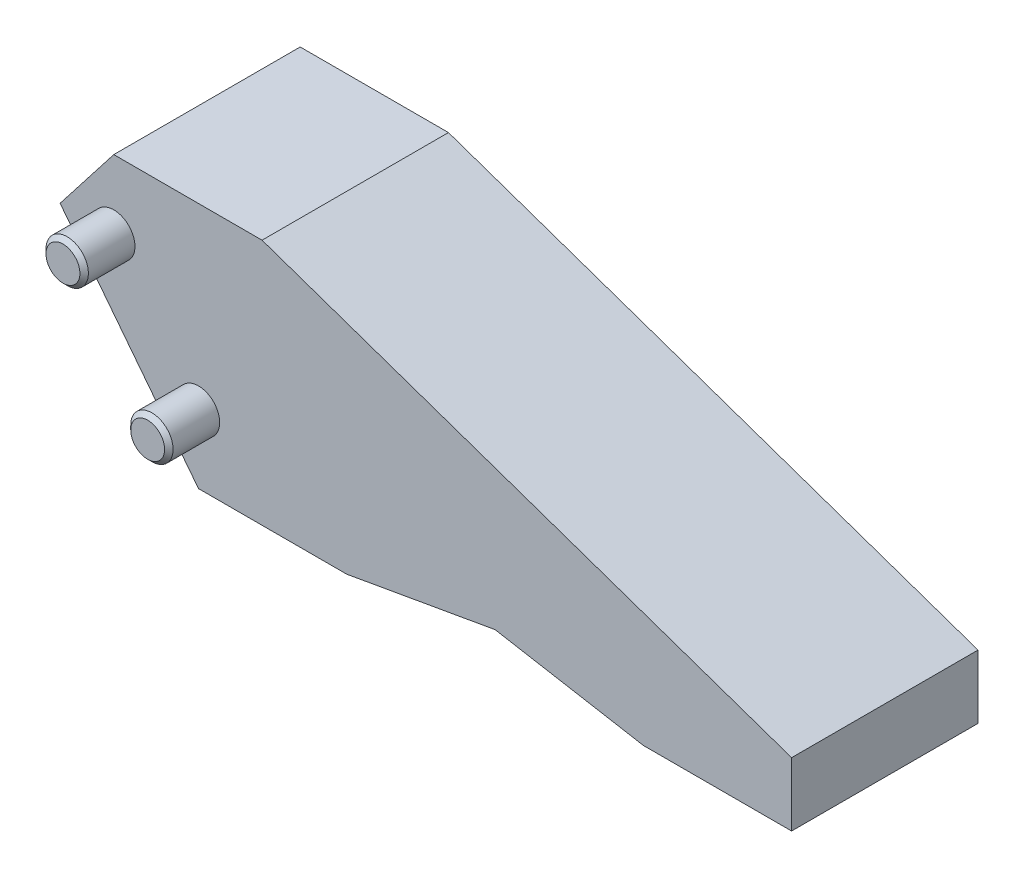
ISO-10303-21;
HEADER;
FILE_DESCRIPTION(('STEP AP214'),'2;1');
FILE_NAME('part.step','',(''),(''),'','','');
FILE_SCHEMA(('AUTOMOTIVE_DESIGN { 1 0 10303 214 1 1 1 1 }'));
ENDSEC;
DATA;
#1=APPLICATION_CONTEXT('core data for automotive mechanical design processes');
#2=APPLICATION_PROTOCOL_DEFINITION('international standard','automotive_design',2000,#1);
#3=PRODUCT_CONTEXT('',#1,'mechanical');
#4=PRODUCT('Part','Part','',(#3));
#5=PRODUCT_RELATED_PRODUCT_CATEGORY('part','',(#4));
#6=PRODUCT_DEFINITION_FORMATION('','',#4);
#7=PRODUCT_DEFINITION_CONTEXT('part definition',#1,'design');
#8=PRODUCT_DEFINITION('design','',#6,#7);
#9=PRODUCT_DEFINITION_SHAPE('','',#8);
#10=(LENGTH_UNIT() NAMED_UNIT(*) SI_UNIT(.MILLI.,.METRE.));
#11=(NAMED_UNIT(*) PLANE_ANGLE_UNIT() SI_UNIT($,.RADIAN.));
#12=(NAMED_UNIT(*) SI_UNIT($,.STERADIAN.) SOLID_ANGLE_UNIT());
#13=UNCERTAINTY_MEASURE_WITH_UNIT(LENGTH_MEASURE(1.E-05),#10,'distance_accuracy_value','');
#14=(GEOMETRIC_REPRESENTATION_CONTEXT(3) GLOBAL_UNCERTAINTY_ASSIGNED_CONTEXT((#13)) GLOBAL_UNIT_ASSIGNED_CONTEXT((#10,
#11,#12)) REPRESENTATION_CONTEXT('',''));
#15=CARTESIAN_POINT('',(0.,0.,0.));
#16=DIRECTION('',(0.,0.,1.));
#17=DIRECTION('',(1.,0.,0.));
#18=AXIS2_PLACEMENT_3D('',#15,#16,#17);
#19=CARTESIAN_POINT('',(-12.6689495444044,0.,22.));
#20=DIRECTION('',(0.,0.,1.));
#21=DIRECTION('',(1.,0.,0.));
#22=AXIS2_PLACEMENT_3D('',#19,#20,#21);
#23=PLANE('',#22);
#24=CARTESIAN_POINT('',(0.,0.,22.));
#25=DIRECTION('',(0.,0.,1.));
#26=DIRECTION('',(1.,0.,0.));
#27=AXIS2_PLACEMENT_3D('',#24,#25,#26);
#28=CIRCLE('',#27,5.);
#29=CARTESIAN_POINT('',(5.,0.,22.));
#30=VERTEX_POINT('',#29);
#31=EDGE_CURVE('E127',#30,#30,#28,.T.);
#32=ORIENTED_EDGE('',*,*,#31,.F.);
#33=EDGE_LOOP('',(#32));
#34=FACE_BOUND('',#33,.T.);
#35=DIRECTION('',(-0.613967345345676,-0.789331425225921,0.));
#36=VECTOR('',#35,1.);
#37=CARTESIAN_POINT('',(-12.6689495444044,0.,22.));
#38=LINE('',#37,#36);
#39=CARTESIAN_POINT('',(0.,16.2875111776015,22.));
#40=VERTEX_POINT('',#39);
#41=CARTESIAN_POINT('',(-12.6689495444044,0.,22.));
#42=VERTEX_POINT('',#41);
#43=EDGE_CURVE('E147',#40,#42,#38,.T.);
#44=ORIENTED_EDGE('',*,*,#43,.T.);
#45=DIRECTION('',(0.613967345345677,-0.78933142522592,0.));
#46=VECTOR('',#45,1.);
#47=CARTESIAN_POINT('',(20.,-42.,22.));
#48=LINE('',#47,#46);
#49=CARTESIAN_POINT('',(20.,-42.,22.));
#50=VERTEX_POINT('',#49);
#51=EDGE_CURVE('E119',#42,#50,#48,.T.);
#52=ORIENTED_EDGE('',*,*,#51,.T.);
#53=DIRECTION('',(1.,0.,0.));
#54=VECTOR('',#53,1.);
#55=CARTESIAN_POINT('',(55.,-42.,22.));
#56=LINE('',#55,#54);
#57=CARTESIAN_POINT('',(55.,-42.,22.));
#58=VERTEX_POINT('',#57);
#59=EDGE_CURVE('E150',#50,#58,#56,.T.);
#60=ORIENTED_EDGE('',*,*,#59,.T.);
#61=DIRECTION('',(0.984807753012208,0.173648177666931,0.));
#62=VECTOR('',#61,1.);
#63=CARTESIAN_POINT('',(90.,-35.8285556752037,22.));
#64=LINE('',#63,#62);
#65=CARTESIAN_POINT('',(90.,-35.8285556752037,22.));
#66=VERTEX_POINT('',#65);
#67=EDGE_CURVE('E152',#58,#66,#64,.T.);
#68=ORIENTED_EDGE('',*,*,#67,.T.);
#69=DIRECTION('',(0.984807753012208,-0.173648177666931,0.));
#70=VECTOR('',#69,1.);
#71=CARTESIAN_POINT('',(125.,-42.,22.));
#72=LINE('',#71,#70);
#73=CARTESIAN_POINT('',(125.,-42.,22.));
#74=VERTEX_POINT('',#73);
#75=EDGE_CURVE('E154',#66,#74,#72,.T.);
#76=ORIENTED_EDGE('',*,*,#75,.T.);
#77=DIRECTION('',(1.,0.,0.));
#78=VECTOR('',#77,1.);
#79=CARTESIAN_POINT('',(160.,-42.,22.));
#80=LINE('',#79,#78);
#81=CARTESIAN_POINT('',(160.,-42.,22.));
#82=VERTEX_POINT('',#81);
#83=EDGE_CURVE('E156',#74,#82,#80,.T.);
#84=ORIENTED_EDGE('',*,*,#83,.T.);
#85=DIRECTION('',(0.,1.,0.));
#86=VECTOR('',#85,1.);
#87=CARTESIAN_POINT('',(160.,-27.,22.));
#88=LINE('',#87,#86);
#89=CARTESIAN_POINT('',(160.,-27.,22.));
#90=VERTEX_POINT('',#89);
#91=EDGE_CURVE('E158',#82,#90,#88,.T.);
#92=ORIENTED_EDGE('',*,*,#91,.T.);
#93=DIRECTION('',(-0.944943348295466,0.327233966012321,0.));
#94=VECTOR('',#93,1.);
#95=CARTESIAN_POINT('',(35.,16.2875111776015,22.));
#96=LINE('',#95,#94);
#97=CARTESIAN_POINT('',(35.,16.2875111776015,22.));
#98=VERTEX_POINT('',#97);
#99=EDGE_CURVE('E52',#90,#98,#96,.T.);
#100=ORIENTED_EDGE('',*,*,#99,.T.);
#101=DIRECTION('',(-1.,0.,0.));
#102=VECTOR('',#101,1.);
#103=CARTESIAN_POINT('',(0.,16.2875111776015,22.));
#104=LINE('',#103,#102);
#105=EDGE_CURVE('E47',#98,#40,#104,.T.);
#106=ORIENTED_EDGE('',*,*,#105,.T.);
#107=EDGE_LOOP('',(#44,#52,#60,#68,#76,#84,#92,#100,#106));
#108=FACE_BOUND('',#107,.T.);
#109=CARTESIAN_POINT('',(20.,-26.,22.));
#110=DIRECTION('',(0.,0.,1.));
#111=DIRECTION('',(1.,0.,0.));
#112=AXIS2_PLACEMENT_3D('',#109,#110,#111);
#113=CIRCLE('',#112,5.);
#114=CARTESIAN_POINT('',(25.,-26.,22.));
#115=VERTEX_POINT('',#114);
#116=EDGE_CURVE('E130',#115,#115,#113,.T.);
#117=ORIENTED_EDGE('',*,*,#116,.F.);
#118=EDGE_LOOP('',(#117));
#119=FACE_BOUND('',#118,.T.);
#120=ADVANCED_FACE('F32',(#34,#108,#119),#23,.T.);
#121=CARTESIAN_POINT('',(-12.6689495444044,0.,-22.));
#122=DIRECTION('',(0.,0.,1.));
#123=DIRECTION('',(1.,0.,0.));
#124=AXIS2_PLACEMENT_3D('',#121,#122,#123);
#125=PLANE('',#124);
#126=CARTESIAN_POINT('',(0.,0.,-22.));
#127=DIRECTION('',(0.,0.,1.));
#128=DIRECTION('',(1.,0.,0.));
#129=AXIS2_PLACEMENT_3D('',#126,#127,#128);
#130=CIRCLE('',#129,5.);
#131=CARTESIAN_POINT('',(5.,0.,-22.));
#132=VERTEX_POINT('',#131);
#133=EDGE_CURVE('E433',#132,#132,#130,.F.);
#134=ORIENTED_EDGE('',*,*,#133,.F.);
#135=EDGE_LOOP('',(#134));
#136=FACE_BOUND('',#135,.T.);
#137=DIRECTION('',(-0.613967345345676,-0.789331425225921,0.));
#138=VECTOR('',#137,1.);
#139=CARTESIAN_POINT('',(-12.6689495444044,0.,-22.));
#140=LINE('',#139,#138);
#141=CARTESIAN_POINT('',(0.,16.2875111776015,-22.));
#142=VERTEX_POINT('',#141);
#143=CARTESIAN_POINT('',(-12.6689495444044,0.,-22.));
#144=VERTEX_POINT('',#143);
#145=EDGE_CURVE('E109',#142,#144,#140,.T.);
#146=ORIENTED_EDGE('',*,*,#145,.F.);
#147=DIRECTION('',(-1.,0.,0.));
#148=VECTOR('',#147,1.);
#149=CARTESIAN_POINT('',(0.,16.2875111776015,-22.));
#150=LINE('',#149,#148);
#151=CARTESIAN_POINT('',(35.,16.2875111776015,-22.));
#152=VERTEX_POINT('',#151);
#153=EDGE_CURVE('E145',#152,#142,#150,.T.);
#154=ORIENTED_EDGE('',*,*,#153,.F.);
#155=DIRECTION('',(-0.944943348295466,0.327233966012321,0.));
#156=VECTOR('',#155,1.);
#157=CARTESIAN_POINT('',(35.,16.2875111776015,-22.));
#158=LINE('',#157,#156);
#159=CARTESIAN_POINT('',(160.,-27.,-22.));
#160=VERTEX_POINT('',#159);
#161=EDGE_CURVE('E143',#160,#152,#158,.T.);
#162=ORIENTED_EDGE('',*,*,#161,.F.);
#163=DIRECTION('',(0.,1.,0.));
#164=VECTOR('',#163,1.);
#165=CARTESIAN_POINT('',(160.,-27.,-22.));
#166=LINE('',#165,#164);
#167=CARTESIAN_POINT('',(160.,-42.,-22.));
#168=VERTEX_POINT('',#167);
#169=EDGE_CURVE('E141',#168,#160,#166,.T.);
#170=ORIENTED_EDGE('',*,*,#169,.F.);
#171=DIRECTION('',(1.,0.,0.));
#172=VECTOR('',#171,1.);
#173=CARTESIAN_POINT('',(160.,-42.,-22.));
#174=LINE('',#173,#172);
#175=CARTESIAN_POINT('',(125.,-42.,-22.));
#176=VERTEX_POINT('',#175);
#177=EDGE_CURVE('E139',#176,#168,#174,.T.);
#178=ORIENTED_EDGE('',*,*,#177,.F.);
#179=DIRECTION('',(0.984807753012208,-0.173648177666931,0.));
#180=VECTOR('',#179,1.);
#181=CARTESIAN_POINT('',(125.,-42.,-22.));
#182=LINE('',#181,#180);
#183=CARTESIAN_POINT('',(90.,-35.8285556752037,-22.));
#184=VERTEX_POINT('',#183);
#185=EDGE_CURVE('E137',#184,#176,#182,.T.);
#186=ORIENTED_EDGE('',*,*,#185,.F.);
#187=DIRECTION('',(0.984807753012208,0.173648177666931,0.));
#188=VECTOR('',#187,1.);
#189=CARTESIAN_POINT('',(90.,-35.8285556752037,-22.));
#190=LINE('',#189,#188);
#191=CARTESIAN_POINT('',(55.,-42.,-22.));
#192=VERTEX_POINT('',#191);
#193=EDGE_CURVE('E135',#192,#184,#190,.T.);
#194=ORIENTED_EDGE('',*,*,#193,.F.);
#195=DIRECTION('',(1.,0.,0.));
#196=VECTOR('',#195,1.);
#197=CARTESIAN_POINT('',(55.,-42.,-22.));
#198=LINE('',#197,#196);
#199=CARTESIAN_POINT('',(20.,-42.,-22.));
#200=VERTEX_POINT('',#199);
#201=EDGE_CURVE('E111',#200,#192,#198,.T.);
#202=ORIENTED_EDGE('',*,*,#201,.F.);
#203=DIRECTION('',(0.613967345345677,-0.78933142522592,0.));
#204=VECTOR('',#203,1.);
#205=CARTESIAN_POINT('',(20.,-42.,-22.));
#206=LINE('',#205,#204);
#207=EDGE_CURVE('E103',#144,#200,#206,.T.);
#208=ORIENTED_EDGE('',*,*,#207,.F.);
#209=EDGE_LOOP('',(#146,#154,#162,#170,#178,#186,#194,#202,#208));
#210=FACE_BOUND('',#209,.T.);
#211=CARTESIAN_POINT('',(20.,-26.,-22.));
#212=DIRECTION('',(0.,0.,1.));
#213=DIRECTION('',(1.,0.,0.));
#214=AXIS2_PLACEMENT_3D('',#211,#212,#213);
#215=CIRCLE('',#214,5.);
#216=CARTESIAN_POINT('',(25.,-26.,-22.));
#217=VERTEX_POINT('',#216);
#218=EDGE_CURVE('E431',#217,#217,#215,.F.);
#219=ORIENTED_EDGE('',*,*,#218,.F.);
#220=EDGE_LOOP('',(#219));
#221=FACE_BOUND('',#220,.T.);
#222=ADVANCED_FACE('F105',(#136,#210,#221),#125,.F.);
#223=CARTESIAN_POINT('',(-12.6689495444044,0.,22.));
#224=DIRECTION('',(0.789331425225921,-0.613967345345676,0.));
#225=DIRECTION('',(0.613967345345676,0.789331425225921,0.));
#226=AXIS2_PLACEMENT_3D('',#223,#224,#225);
#227=PLANE('',#226);
#228=ORIENTED_EDGE('',*,*,#145,.T.);
#229=DIRECTION('',(0.,0.,-1.));
#230=VECTOR('',#229,1.);
#231=CARTESIAN_POINT('',(-12.6689495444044,0.,22.));
#232=LINE('',#231,#230);
#233=EDGE_CURVE('E117',#42,#144,#232,.T.);
#234=ORIENTED_EDGE('',*,*,#233,.F.);
#235=ORIENTED_EDGE('',*,*,#43,.F.);
#236=DIRECTION('',(0.,0.,-1.));
#237=VECTOR('',#236,1.);
#238=CARTESIAN_POINT('',(0.,16.2875111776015,22.));
#239=LINE('',#238,#237);
#240=EDGE_CURVE('E126',#40,#142,#239,.T.);
#241=ORIENTED_EDGE('',*,*,#240,.T.);
#242=EDGE_LOOP('',(#228,#234,#235,#241));
#243=FACE_BOUND('',#242,.T.);
#244=ADVANCED_FACE('F34',(#243),#227,.F.);
#245=CARTESIAN_POINT('',(20.,-42.,22.));
#246=DIRECTION('',(0.78933142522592,0.613967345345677,0.));
#247=DIRECTION('',(-0.613967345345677,0.78933142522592,0.));
#248=AXIS2_PLACEMENT_3D('',#245,#246,#247);
#249=PLANE('',#248);
#250=ORIENTED_EDGE('',*,*,#207,.T.);
#251=DIRECTION('',(0.,0.,-1.));
#252=VECTOR('',#251,1.);
#253=CARTESIAN_POINT('',(20.,-42.,22.));
#254=LINE('',#253,#252);
#255=EDGE_CURVE('E123',#50,#200,#254,.T.);
#256=ORIENTED_EDGE('',*,*,#255,.F.);
#257=ORIENTED_EDGE('',*,*,#51,.F.);
#258=ORIENTED_EDGE('',*,*,#233,.T.);
#259=EDGE_LOOP('',(#250,#256,#257,#258));
#260=FACE_BOUND('',#259,.T.);
#261=ADVANCED_FACE('F118',(#260),#249,.F.);
#262=CARTESIAN_POINT('',(55.,-42.,22.));
#263=DIRECTION('',(0.,1.,0.));
#264=DIRECTION('',(-1.,0.,0.));
#265=AXIS2_PLACEMENT_3D('',#262,#263,#264);
#266=PLANE('',#265);
#267=ORIENTED_EDGE('',*,*,#201,.T.);
#268=DIRECTION('',(0.,0.,-1.));
#269=VECTOR('',#268,1.);
#270=CARTESIAN_POINT('',(55.,-42.,22.));
#271=LINE('',#270,#269);
#272=EDGE_CURVE('E178',#58,#192,#271,.T.);
#273=ORIENTED_EDGE('',*,*,#272,.F.);
#274=ORIENTED_EDGE('',*,*,#59,.F.);
#275=ORIENTED_EDGE('',*,*,#255,.T.);
#276=EDGE_LOOP('',(#267,#273,#274,#275));
#277=FACE_BOUND('',#276,.T.);
#278=ADVANCED_FACE('F251',(#277),#266,.F.);
#279=CARTESIAN_POINT('',(90.,-35.8285556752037,22.));
#280=DIRECTION('',(-0.173648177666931,0.984807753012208,0.));
#281=DIRECTION('',(-0.984807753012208,-0.173648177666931,0.));
#282=AXIS2_PLACEMENT_3D('',#279,#280,#281);
#283=PLANE('',#282);
#284=ORIENTED_EDGE('',*,*,#193,.T.);
#285=DIRECTION('',(0.,0.,-1.));
#286=VECTOR('',#285,1.);
#287=CARTESIAN_POINT('',(90.,-35.8285556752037,22.));
#288=LINE('',#287,#286);
#289=EDGE_CURVE('E175',#66,#184,#288,.T.);
#290=ORIENTED_EDGE('',*,*,#289,.F.);
#291=ORIENTED_EDGE('',*,*,#67,.F.);
#292=ORIENTED_EDGE('',*,*,#272,.T.);
#293=EDGE_LOOP('',(#284,#290,#291,#292));
#294=FACE_BOUND('',#293,.T.);
#295=ADVANCED_FACE('F247',(#294),#283,.F.);
#296=CARTESIAN_POINT('',(125.,-42.,22.));
#297=DIRECTION('',(0.173648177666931,0.984807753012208,0.));
#298=DIRECTION('',(-0.984807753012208,0.173648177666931,0.));
#299=AXIS2_PLACEMENT_3D('',#296,#297,#298);
#300=PLANE('',#299);
#301=ORIENTED_EDGE('',*,*,#185,.T.);
#302=DIRECTION('',(0.,0.,-1.));
#303=VECTOR('',#302,1.);
#304=CARTESIAN_POINT('',(125.,-42.,22.));
#305=LINE('',#304,#303);
#306=EDGE_CURVE('E172',#74,#176,#305,.T.);
#307=ORIENTED_EDGE('',*,*,#306,.F.);
#308=ORIENTED_EDGE('',*,*,#75,.F.);
#309=ORIENTED_EDGE('',*,*,#289,.T.);
#310=EDGE_LOOP('',(#301,#307,#308,#309));
#311=FACE_BOUND('',#310,.T.);
#312=ADVANCED_FACE('F243',(#311),#300,.F.);
#313=CARTESIAN_POINT('',(160.,-42.,22.));
#314=DIRECTION('',(0.,1.,0.));
#315=DIRECTION('',(0.,0.,1.));
#316=AXIS2_PLACEMENT_3D('',#313,#314,#315);
#317=PLANE('',#316);
#318=ORIENTED_EDGE('',*,*,#177,.T.);
#319=DIRECTION('',(0.,0.,-1.));
#320=VECTOR('',#319,1.);
#321=CARTESIAN_POINT('',(160.,-42.,22.));
#322=LINE('',#321,#320);
#323=EDGE_CURVE('E169',#82,#168,#322,.T.);
#324=ORIENTED_EDGE('',*,*,#323,.F.);
#325=ORIENTED_EDGE('',*,*,#83,.F.);
#326=ORIENTED_EDGE('',*,*,#306,.T.);
#327=EDGE_LOOP('',(#318,#324,#325,#326));
#328=FACE_BOUND('',#327,.T.);
#329=ADVANCED_FACE('F239',(#328),#317,.F.);
#330=CARTESIAN_POINT('',(160.,-27.,22.));
#331=DIRECTION('',(-1.,0.,0.));
#332=DIRECTION('',(0.,0.,1.));
#333=AXIS2_PLACEMENT_3D('',#330,#331,#332);
#334=PLANE('',#333);
#335=ORIENTED_EDGE('',*,*,#169,.T.);
#336=DIRECTION('',(0.,0.,-1.));
#337=VECTOR('',#336,1.);
#338=CARTESIAN_POINT('',(160.,-27.,22.));
#339=LINE('',#338,#337);
#340=EDGE_CURVE('E166',#90,#160,#339,.T.);
#341=ORIENTED_EDGE('',*,*,#340,.F.);
#342=ORIENTED_EDGE('',*,*,#91,.F.);
#343=ORIENTED_EDGE('',*,*,#323,.T.);
#344=EDGE_LOOP('',(#335,#341,#342,#343));
#345=FACE_BOUND('',#344,.T.);
#346=ADVANCED_FACE('F235',(#345),#334,.F.);
#347=CARTESIAN_POINT('',(35.,16.2875111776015,22.));
#348=DIRECTION('',(-0.327233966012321,-0.944943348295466,0.));
#349=DIRECTION('',(0.944943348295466,-0.327233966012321,0.));
#350=AXIS2_PLACEMENT_3D('',#347,#348,#349);
#351=PLANE('',#350);
#352=ORIENTED_EDGE('',*,*,#161,.T.);
#353=DIRECTION('',(0.,0.,-1.));
#354=VECTOR('',#353,1.);
#355=CARTESIAN_POINT('',(35.,16.2875111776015,22.));
#356=LINE('',#355,#354);
#357=EDGE_CURVE('E163',#98,#152,#356,.T.);
#358=ORIENTED_EDGE('',*,*,#357,.F.);
#359=ORIENTED_EDGE('',*,*,#99,.F.);
#360=ORIENTED_EDGE('',*,*,#340,.T.);
#361=EDGE_LOOP('',(#352,#358,#359,#360));
#362=FACE_BOUND('',#361,.T.);
#363=ADVANCED_FACE('F231',(#362),#351,.F.);
#364=CARTESIAN_POINT('',(0.,16.2875111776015,22.));
#365=DIRECTION('',(0.,-1.,0.));
#366=DIRECTION('',(1.,0.,0.));
#367=AXIS2_PLACEMENT_3D('',#364,#365,#366);
#368=PLANE('',#367);
#369=ORIENTED_EDGE('',*,*,#153,.T.);
#370=ORIENTED_EDGE('',*,*,#240,.F.);
#371=ORIENTED_EDGE('',*,*,#105,.F.);
#372=ORIENTED_EDGE('',*,*,#357,.T.);
#373=EDGE_LOOP('',(#369,#370,#371,#372));
#374=FACE_BOUND('',#373,.T.);
#375=ADVANCED_FACE('F227',(#374),#368,.F.);
#376=CARTESIAN_POINT('',(20.,-26.,-34.));
#377=DIRECTION('',(0.,0.,1.));
#378=DIRECTION('',(1.,0.,0.));
#379=AXIS2_PLACEMENT_3D('',#376,#377,#378);
#380=PLANE('',#379);
#381=CARTESIAN_POINT('',(20.,-26.,-34.));
#382=DIRECTION('',(0.,0.,1.));
#383=DIRECTION('',(1.,0.,0.));
#384=AXIS2_PLACEMENT_3D('',#381,#382,#383);
#385=CIRCLE('',#384,3.99999999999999);
#386=CARTESIAN_POINT('',(24.,-26.,-34.));
#387=VERTEX_POINT('',#386);
#388=EDGE_CURVE('E11',#387,#387,#385,.F.);
#389=ORIENTED_EDGE('',*,*,#388,.T.);
#390=EDGE_LOOP('',(#389));
#391=FACE_BOUND('',#390,.T.);
#392=ADVANCED_FACE('F230',(#391),#380,.F.);
#393=CARTESIAN_POINT('',(20.,-26.,34.));
#394=DIRECTION('',(0.,0.,-1.));
#395=DIRECTION('',(-1.,0.,0.));
#396=AXIS2_PLACEMENT_3D('',#393,#394,#395);
#397=CYLINDRICAL_SURFACE('',#396,5.);
#398=CARTESIAN_POINT('',(20.,-26.,-33.));
#399=DIRECTION('',(0.,0.,1.));
#400=DIRECTION('',(1.,0.,0.));
#401=AXIS2_PLACEMENT_3D('',#398,#399,#400);
#402=CIRCLE('',#401,5.);
#403=CARTESIAN_POINT('',(25.,-26.,-33.));
#404=VERTEX_POINT('',#403);
#405=EDGE_CURVE('E40',#404,#404,#402,.T.);
#406=ORIENTED_EDGE('',*,*,#405,.T.);
#407=EDGE_LOOP('',(#406));
#408=FACE_BOUND('',#407,.T.);
#409=ORIENTED_EDGE('',*,*,#218,.T.);
#410=EDGE_LOOP('',(#409));
#411=FACE_BOUND('',#410,.T.);
#412=ADVANCED_FACE('F201',(#408,#411),#397,.T.);
#413=CARTESIAN_POINT('',(20.,-26.,33.));
#414=DIRECTION('',(0.,0.,1.));
#415=DIRECTION('',(1.,0.,0.));
#416=AXIS2_PLACEMENT_3D('',#413,#414,#415);
#417=CIRCLE('',#416,5.);
#418=CARTESIAN_POINT('',(25.,-26.,33.));
#419=VERTEX_POINT('',#418);
#420=EDGE_CURVE('E190',#419,#419,#417,.F.);
#421=ORIENTED_EDGE('',*,*,#420,.T.);
#422=EDGE_LOOP('',(#421));
#423=FACE_BOUND('',#422,.T.);
#424=ORIENTED_EDGE('',*,*,#116,.T.);
#425=EDGE_LOOP('',(#424));
#426=FACE_BOUND('',#425,.T.);
#427=ADVANCED_FACE('F328',(#423,#426),#397,.T.);
#428=CARTESIAN_POINT('',(20.,-26.,34.));
#429=DIRECTION('',(0.,0.,1.));
#430=DIRECTION('',(1.,0.,0.));
#431=AXIS2_PLACEMENT_3D('',#428,#429,#430);
#432=PLANE('',#431);
#433=CARTESIAN_POINT('',(20.,-26.,34.));
#434=DIRECTION('',(0.,0.,1.));
#435=DIRECTION('',(1.,0.,0.));
#436=AXIS2_PLACEMENT_3D('',#433,#434,#435);
#437=CIRCLE('',#436,3.99999999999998);
#438=CARTESIAN_POINT('',(24.,-26.,34.));
#439=VERTEX_POINT('',#438);
#440=EDGE_CURVE('E187',#439,#439,#437,.T.);
#441=ORIENTED_EDGE('',*,*,#440,.T.);
#442=EDGE_LOOP('',(#441));
#443=FACE_BOUND('',#442,.T.);
#444=ADVANCED_FACE('F335',(#443),#432,.T.);
#445=CARTESIAN_POINT('',(0.,0.,-34.));
#446=DIRECTION('',(0.,0.,1.));
#447=DIRECTION('',(1.,0.,0.));
#448=AXIS2_PLACEMENT_3D('',#445,#446,#447);
#449=PLANE('',#448);
#450=CARTESIAN_POINT('',(0.,0.,-34.));
#451=DIRECTION('',(0.,0.,1.));
#452=DIRECTION('',(1.,0.,0.));
#453=AXIS2_PLACEMENT_3D('',#450,#451,#452);
#454=CIRCLE('',#453,3.99999999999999);
#455=CARTESIAN_POINT('',(3.99999999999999,0.,-34.));
#456=VERTEX_POINT('',#455);
#457=EDGE_CURVE('E196',#456,#456,#454,.F.);
#458=ORIENTED_EDGE('',*,*,#457,.T.);
#459=EDGE_LOOP('',(#458));
#460=FACE_BOUND('',#459,.T.);
#461=ADVANCED_FACE('F343',(#460),#449,.F.);
#462=CARTESIAN_POINT('',(0.,0.,34.));
#463=DIRECTION('',(0.,0.,-1.));
#464=DIRECTION('',(-1.,0.,0.));
#465=AXIS2_PLACEMENT_3D('',#462,#463,#464);
#466=CYLINDRICAL_SURFACE('',#465,5.);
#467=CARTESIAN_POINT('',(0.,0.,-33.));
#468=DIRECTION('',(0.,0.,1.));
#469=DIRECTION('',(1.,0.,0.));
#470=AXIS2_PLACEMENT_3D('',#467,#468,#469);
#471=CIRCLE('',#470,5.);
#472=CARTESIAN_POINT('',(5.,0.,-33.));
#473=VERTEX_POINT('',#472);
#474=EDGE_CURVE('E193',#473,#473,#471,.T.);
#475=ORIENTED_EDGE('',*,*,#474,.T.);
#476=EDGE_LOOP('',(#475));
#477=FACE_BOUND('',#476,.T.);
#478=ORIENTED_EDGE('',*,*,#133,.T.);
#479=EDGE_LOOP('',(#478));
#480=FACE_BOUND('',#479,.T.);
#481=ADVANCED_FACE('F352',(#477,#480),#466,.T.);
#482=CARTESIAN_POINT('',(0.,0.,33.));
#483=DIRECTION('',(0.,0.,1.));
#484=DIRECTION('',(1.,0.,0.));
#485=AXIS2_PLACEMENT_3D('',#482,#483,#484);
#486=CIRCLE('',#485,5.);
#487=CARTESIAN_POINT('',(5.,0.,33.));
#488=VERTEX_POINT('',#487);
#489=EDGE_CURVE('E184',#488,#488,#486,.F.);
#490=ORIENTED_EDGE('',*,*,#489,.T.);
#491=EDGE_LOOP('',(#490));
#492=FACE_BOUND('',#491,.T.);
#493=ORIENTED_EDGE('',*,*,#31,.T.);
#494=EDGE_LOOP('',(#493));
#495=FACE_BOUND('',#494,.T.);
#496=ADVANCED_FACE('F361',(#492,#495),#466,.T.);
#497=CARTESIAN_POINT('',(0.,0.,34.));
#498=DIRECTION('',(0.,0.,1.));
#499=DIRECTION('',(1.,0.,0.));
#500=AXIS2_PLACEMENT_3D('',#497,#498,#499);
#501=PLANE('',#500);
#502=CARTESIAN_POINT('',(0.,0.,34.));
#503=DIRECTION('',(0.,0.,1.));
#504=DIRECTION('',(1.,0.,0.));
#505=AXIS2_PLACEMENT_3D('',#502,#503,#504);
#506=CIRCLE('',#505,3.99999999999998);
#507=CARTESIAN_POINT('',(3.99999999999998,0.,34.));
#508=VERTEX_POINT('',#507);
#509=EDGE_CURVE('E122',#508,#508,#506,.T.);
#510=ORIENTED_EDGE('',*,*,#509,.T.);
#511=EDGE_LOOP('',(#510));
#512=FACE_BOUND('',#511,.T.);
#513=ADVANCED_FACE('F370',(#512),#501,.T.);
#514=CARTESIAN_POINT('',(0.,0.,34.));
#515=DIRECTION('',(0.,0.,-1.));
#516=DIRECTION('',(-1.,0.,0.));
#517=AXIS2_PLACEMENT_3D('',#514,#515,#516);
#518=CONICAL_SURFACE('',#517,3.99999999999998,0.785398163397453);
#519=ORIENTED_EDGE('',*,*,#489,.F.);
#520=EDGE_LOOP('',(#519));
#521=FACE_BOUND('',#520,.T.);
#522=ORIENTED_EDGE('',*,*,#509,.F.);
#523=EDGE_LOOP('',(#522));
#524=FACE_BOUND('',#523,.T.);
#525=ADVANCED_FACE('F378',(#521,#524),#518,.T.);
#526=CARTESIAN_POINT('',(20.,-26.,34.));
#527=DIRECTION('',(0.,0.,-1.));
#528=DIRECTION('',(-1.,0.,0.));
#529=AXIS2_PLACEMENT_3D('',#526,#527,#528);
#530=CONICAL_SURFACE('',#529,3.99999999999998,0.785398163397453);
#531=ORIENTED_EDGE('',*,*,#420,.F.);
#532=EDGE_LOOP('',(#531));
#533=FACE_BOUND('',#532,.T.);
#534=ORIENTED_EDGE('',*,*,#440,.F.);
#535=EDGE_LOOP('',(#534));
#536=FACE_BOUND('',#535,.T.);
#537=ADVANCED_FACE('F212',(#533,#536),#530,.T.);
#538=CARTESIAN_POINT('',(0.,0.,-33.));
#539=DIRECTION('',(0.,0.,1.));
#540=DIRECTION('',(1.,0.,0.));
#541=AXIS2_PLACEMENT_3D('',#538,#539,#540);
#542=CONICAL_SURFACE('',#541,5.,0.785398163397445);
#543=ORIENTED_EDGE('',*,*,#457,.F.);
#544=EDGE_LOOP('',(#543));
#545=FACE_BOUND('',#544,.T.);
#546=ORIENTED_EDGE('',*,*,#474,.F.);
#547=EDGE_LOOP('',(#546));
#548=FACE_BOUND('',#547,.T.);
#549=ADVANCED_FACE('F206',(#545,#548),#542,.T.);
#550=CARTESIAN_POINT('',(20.,-26.,-33.));
#551=DIRECTION('',(0.,0.,1.));
#552=DIRECTION('',(1.,0.,0.));
#553=AXIS2_PLACEMENT_3D('',#550,#551,#552);
#554=CONICAL_SURFACE('',#553,5.,0.785398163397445);
#555=ORIENTED_EDGE('',*,*,#388,.F.);
#556=EDGE_LOOP('',(#555));
#557=FACE_BOUND('',#556,.T.);
#558=ORIENTED_EDGE('',*,*,#405,.F.);
#559=EDGE_LOOP('',(#558));
#560=FACE_BOUND('',#559,.T.);
#561=ADVANCED_FACE('F204',(#557,#560),#554,.T.);
#562=CLOSED_SHELL('',(#120,#222,#244,#261,#278,#295,#312,#329,#346,#363,#375,#392,#412,#427,
#444,#461,#481,#496,#513,#525,#537,#549,#561));
#563=MANIFOLD_SOLID_BREP('B2',#562);
#564=ADVANCED_BREP_SHAPE_REPRESENTATION('',(#18,#563),#14);
#565=SHAPE_DEFINITION_REPRESENTATION(#9,#564);
ENDSEC;
END-ISO-10303-21;
